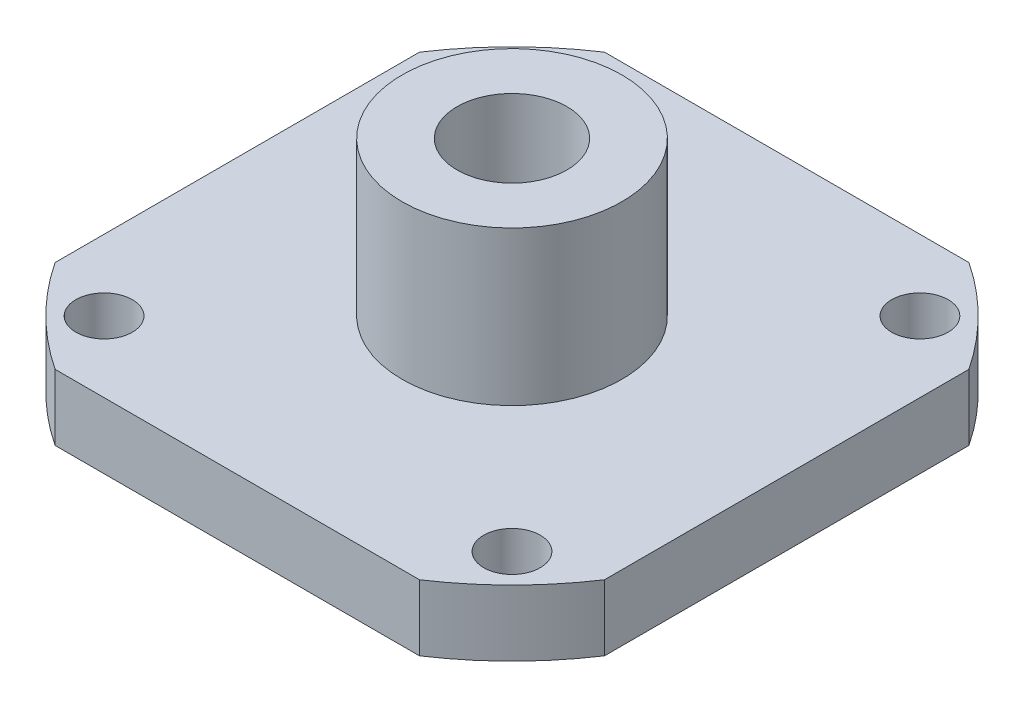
from build123d import *

# Parameters (mm, degrees)
F_4_CLEARANCE_HOLE1_D = 3.2639
SKETCH5_OUTSIDE_W     = 51.172
SKETCH5_OUTSIDE_H     = 51.172
SKETCH5_OUTSIDE_W_2   = 31.75
SKETCH5_OUTSIDE_H_2   = 31.75
CUT_EXTRUDE1_DEPTH    = 29.369651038


with BuildPart() as part:
    # Sketch1 → Revolve1 (revolve)
    with BuildSketch(Plane.XY, mode=Mode.PRIVATE) as revolve1_sk:
        with BuildLine():
            Line((-3.175, 0), (-3.175, 12.7))
            Line((-3.175, 12.7), (-6.35, 12.7))
            Line((-6.35, 12.7), (-6.35, 3.81))
            Line((-6.35, 3.81), (-19.05, 3.81))
            Line((-19.05, 3.81), (-19.05, 0))
            Line((-19.05, 0), (-13.442610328, 0))
            Line((-13.442610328, 0), (-13.281642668, 1.839868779))
            ThreePointArc((-13.281642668, 1.839868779), (-13.240925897, 1.922434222), (-13.155125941, 1.9558))
            Line((-13.155125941, 1.9558), (-10.263674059, 1.9558))
            ThreePointArc((-10.263674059, 1.9558), (-10.177874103, 1.922434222), (-10.137157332, 1.839868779))
            Line((-10.137157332, 1.839868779), (-9.976189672, 0))
            Line((-9.976189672, 0), (-3.175, 0))
        make_face()
    revolve(revolve1_sk.sketch.rotate(Axis((0, 0, 0), (0, 1, 0)), 270), axis=Axis((0, 0, 0), (0, 1, 0)))

    # 4 Clearance Hole1 (through all)
    with Locations(Plane(origin=(0, 3.81, 0), x_dir=(-1, 0, 0), z_dir=(0, 1, 0))):
        with Locations((11.786586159, -11.786586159), (11.786586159, 11.786586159), (-11.786586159, 11.786586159), (-11.786586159, -11.786586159)):
            Hole(F_4_CLEARANCE_HOLE1_D / 2)

    # Sketch5 outside → Cut-Extrude1 (cut, through all)
    with BuildSketch(Plane(origin=(0, 3.81, 0), x_dir=(1, 0, 0), z_dir=(0, 1, 0))):
        Rectangle(SKETCH5_OUTSIDE_W, SKETCH5_OUTSIDE_H)
        Rectangle(SKETCH5_OUTSIDE_W_2, SKETCH5_OUTSIDE_H_2, mode=Mode.SUBTRACT)
    extrude(amount=-CUT_EXTRUDE1_DEPTH, mode=Mode.SUBTRACT)


solid = part.part
